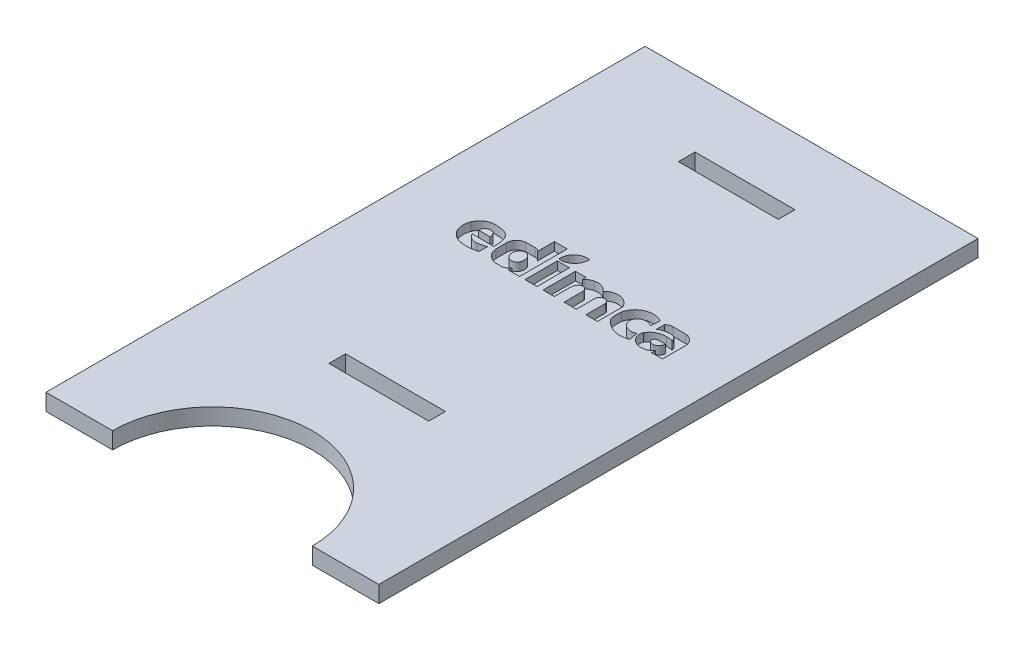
from build123d import *

# Parameters (mm, degrees)
CROQUIS1_W              = 30
CROQUIS1_H              = 5
SALIENTE_EXTRUIR1_DEPTH = 5
CROQUIS2_RX             = 2.186147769
CROQUIS2_RY             = 1.879116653
CROQUIS2_W              = 3.600592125
CROQUIS2_H              = 9.740250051
CORTAR_EXTRUIR1_DEPTH   = 2.5


with BuildPart() as part:
    # Croquis1 → Saliente-Extruir1 (new body)
    with BuildSketch(Plane(origin=(0, 0, 0), x_dir=(1, 0, 0), z_dir=(0, 1, 0))):
        with BuildLine():
            Line((305.516384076, -130.906361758), (285.516384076, -130.906361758))
            Line((285.516384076, -130.906361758), (285.516384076, 49.093638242))
            Line((285.516384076, 49.093638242), (385.516384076, 49.093638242))
            Line((385.516384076, 49.093638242), (385.516384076, -130.906361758))
            Line((385.516384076, -130.906361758), (365.516384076, -130.906361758))
            ThreePointArc((365.516384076, -130.906361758), (335.516384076, -100.906361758), (305.516384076, -130.906361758))
        make_face()
        with Locations((335.516384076, -78.406361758)):
            Rectangle(CROQUIS1_W, CROQUIS1_H, mode=Mode.SUBTRACT)
        with Locations((335.516384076, 26.593638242)):
            Rectangle(CROQUIS1_W, CROQUIS1_H, mode=Mode.SUBTRACT)
    extrude(amount=SALIENTE_EXTRUIR1_DEPTH)

    # Croquis2 → Cortar-Extruir1 (cut)
    # profile 1 of 7: a face of its own
    with BuildSketch(Plane(origin=(0, 5, 0), x_dir=(1, 0, 0), z_dir=(0, 1, 0))):
        with BuildLine():
            Line((336.964972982, -29.640360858), (336.964972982, -24.620108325))
            ThreePointArc((336.964972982, -24.620108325), (337.253991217, -23.563298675), (338.04059748, -22.80065278))
            ThreePointArc((338.04059748, -22.80065278), (339.222614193, -22.843437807), (339.899302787, -23.813533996))
            Line((339.899302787, -23.813533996), (339.899302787, -29.640360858))
            Line((339.899302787, -29.640360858), (343.573511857, -29.640360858))
            Line((343.573511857, -29.640360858), (343.573511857, -24.064903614))
            ThreePointArc((343.573511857, -24.064903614), (344.875507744, -22.616052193), (346.454744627, -23.756391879))
            Line((346.454744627, -23.756391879), (346.454744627, -29.640360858))
            Line((346.454744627, -29.640360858), (349.922303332, -29.640360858))
            Line((349.922303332, -29.640360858), (349.922303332, -21.999714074))
            ThreePointArc((349.922303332, -21.999714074), (346.690366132, -19.622144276), (342.916384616, -20.984245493))
            ThreePointArc((342.916384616, -20.984245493), (341.083207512, -19.683817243), (338.835712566, -19.663362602))
            ThreePointArc((338.835712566, -19.663362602), (337.67574353, -20.138703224), (336.750251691, -20.984245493))
            Line((336.750251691, -20.984245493), (336.750251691, -19.900110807))
            Line((336.750251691, -19.900110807), (333.580784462, -19.900110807))
            Line((333.580784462, -19.900110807), (333.580784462, -29.640360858))
            Line((333.580784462, -29.640360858), (336.964972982, -29.640360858))
        make_face()
    # profile 2 of 7: a face of its own
    with BuildSketch(Plane(origin=(0, 5, 0), x_dir=(1, 0, 0), z_dir=(0, 1, 0))):
        with BuildLine():
            Line((360.823311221, -20.329082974), (360.823311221, -22.827230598))
            ThreePointArc((360.823311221, -22.827230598), (362.455623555, -22.106883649), (364.229876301, -21.918813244))
            ThreePointArc((364.229876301, -21.918813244), (365.464868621, -22.259106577), (366.097516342, -23.373001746))
            ThreePointArc((366.097516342, -23.373001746), (365.167316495, -23.256714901), (364.229876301, -23.256198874))
            ThreePointArc((364.229876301, -23.256198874), (361.631207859, -23.823933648), (359.721950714, -25.675996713))
            ThreePointArc((359.721950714, -25.675996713), (359.705118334, -27.543607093), (360.823311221, -29.039567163))
            ThreePointArc((360.823311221, -29.039567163), (363.63671388, -29.891680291), (366.22862495, -28.504839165))
            Line((366.22862495, -28.504839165), (366.22862495, -29.640360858))
            Line((366.22862495, -29.640360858), (369.449155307, -29.640360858))
            Line((369.449155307, -29.640360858), (369.449155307, -22.827230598))
            ThreePointArc((369.449155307, -22.827230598), (368.588771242, -20.655964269), (366.474675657, -19.663362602))
            Line((366.474675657, -19.663362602), (362.657172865, -19.663362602))
            ThreePointArc((362.657172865, -19.663362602), (361.681694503, -19.834941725), (360.823311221, -20.329082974))
        make_face()
        with BuildLine():
            Line((366.097516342, -25.340678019), (363.944574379, -25.340678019))
            ThreePointArc((363.944574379, -25.340678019), (363.159865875, -25.665714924), (362.83482897, -26.450423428))
            ThreePointArc((362.83482897, -26.450423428), (362.985570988, -26.792681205), (363.258604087, -27.048252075))
            ThreePointArc((363.258604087, -27.048252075), (363.891789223, -27.313700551), (364.575487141, -27.250903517))
            ThreePointArc((364.575487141, -27.250903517), (365.595952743, -26.5025161), (366.097516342, -25.340678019))
        make_face(mode=Mode.SUBTRACT)
    # profile 3 of 7: a face of its own
    with BuildSketch(Plane(origin=(0, 5, 0), x_dir=(1, 0, 0), z_dir=(0, 1, 0))):
        with BuildLine():
            Line((313.94605312, -26.738082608), (313.94605312, -29.232325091))
            ThreePointArc((313.94605312, -29.232325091), (311.525734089, -29.715123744), (309.058863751, -29.640360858))
            ThreePointArc((309.058863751, -29.640360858), (306.594023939, -28.653984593), (304.95564428, -26.564945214))
            ThreePointArc((304.95564428, -26.564945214), (304.638942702, -24.619664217), (305.016857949, -22.685343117))
            add(Edge.make_bspline(
                [(314.910366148, -25.679100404), (314.787058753, -22.95845092), (314.622181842, -20.267345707), (310.991091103, -19.876325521), (307.972239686, -19.551235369), (306.382897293, -20.110531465), (305.016857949, -22.685343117)],
                knots=[0.049601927, 0.049601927, 0.049601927, 0.049601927, 1, 1, 1, 2, 2, 2, 2], degree=3))
            Line((314.910366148, -25.679100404), (308.362208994, -25.679100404))
            ThreePointArc((308.362208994, -25.679100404), (309.60626493, -27.024174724), (311.410661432, -27.342063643))
            ThreePointArc((311.410661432, -27.342063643), (312.690933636, -27.092866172), (313.94605312, -26.738082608))
        make_face()
        with BuildLine():
            Line((311.79019588, -23.756391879), (308.362208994, -23.756391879))
            ThreePointArc((308.362208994, -23.756391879), (310.076202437, -21.878370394), (311.79019588, -23.756391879))
        make_face(mode=Mode.SUBTRACT)
    # profile 4 of 7: a face of its own
    with BuildSketch(Plane(origin=(0, 5, 0), x_dir=(1, 0, 0), z_dir=(0, 1, 0))):
        with BuildLine():
            Line((358.985553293, -26.796037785), (359.449971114, -29.463124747))
            ThreePointArc((359.449971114, -29.463124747), (355.01714587, -29.660285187), (351.36363728, -27.142213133))
            ThreePointArc((351.36363728, -27.142213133), (351.000248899, -25.388949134), (351.063131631, -23.599527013))
            ThreePointArc((351.063131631, -23.599527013), (354.255018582, -19.766944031), (359.231421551, -20.101978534))
            Line((359.231421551, -20.101978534), (358.985553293, -22.827230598))
            ThreePointArc((358.985553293, -22.827230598), (356.912507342, -22.219830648), (355.01714587, -23.256198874))
            ThreePointArc((355.01714587, -23.256198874), (354.561062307, -24.365261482), (354.729993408, -25.552482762))
            ThreePointArc((354.729993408, -25.552482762), (356.600224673, -27.055615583), (358.985553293, -26.796037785))
        make_face()
    # profile 5 of 7: a face of its own
    with BuildSketch(Plane(origin=(0, 5, 0), x_dir=(1, 0, 0), z_dir=(0, 1, 0))):
        with BuildLine():
            Line((322.669782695, -15.332851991), (326.530556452, -15.332851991))
            Line((326.530556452, -15.332851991), (326.530556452, -29.640360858))
            Line((326.530556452, -29.640360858), (323.123991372, -29.640360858))
            Line((323.123991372, -29.640360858), (323.123991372, -28.504839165))
            ThreePointArc((323.123991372, -28.504839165), (322.319822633, -29.390117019), (321.182414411, -29.759855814))
            Line((321.182414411, -29.759855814), (319.523475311, -29.759855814))
            ThreePointArc((319.523475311, -29.759855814), (316.976301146, -28.563432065), (315.800459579, -26.00669144))
            Line((315.800459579, -26.00669144), (315.800459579, -22.827230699))
            ThreePointArc((315.800459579, -22.827230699), (316.608344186, -20.748207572), (318.625180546, -19.79563957))
            Line((318.625180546, -19.79563957), (321.323079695, -19.79563957))
            ThreePointArc((321.323079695, -19.79563957), (322.047344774, -19.933875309), (322.669782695, -20.329147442))
            Line((322.669782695, -20.329147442), (322.669782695, -15.332851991))
        make_face()
        with Locations(Location((321.119111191, -24.620108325), (0, 0, -84.458125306))):
            Ellipse(CROQUIS2_RX, CROQUIS2_RY, mode=Mode.SUBTRACT)
    # profile 6 of 7: a face of its own
    with BuildSketch(Plane(origin=(0, 5, 0), x_dir=(1, 0, 0), z_dir=(0, 1, 0))):
        with Locations((329.953660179, -24.770235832)):
            Rectangle(CROQUIS2_W, CROQUIS2_H)
    # profile 7 of 7: a face of its own
    with BuildSketch(Plane(origin=(0, 5, 0), x_dir=(1, 0, 0), z_dir=(0, 1, 0))):
        with BuildLine():
            ThreePointArc((327.852008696, -19.155335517), (331.305393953, -18.094292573), (332.656842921, -14.743879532))
            ThreePointArc((332.656842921, -14.743879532), (329.157738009, -15.755125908), (327.852008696, -19.155335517))
        make_face()
    extrude(amount=-CORTAR_EXTRUIR1_DEPTH, mode=Mode.SUBTRACT)


solid = part.part
